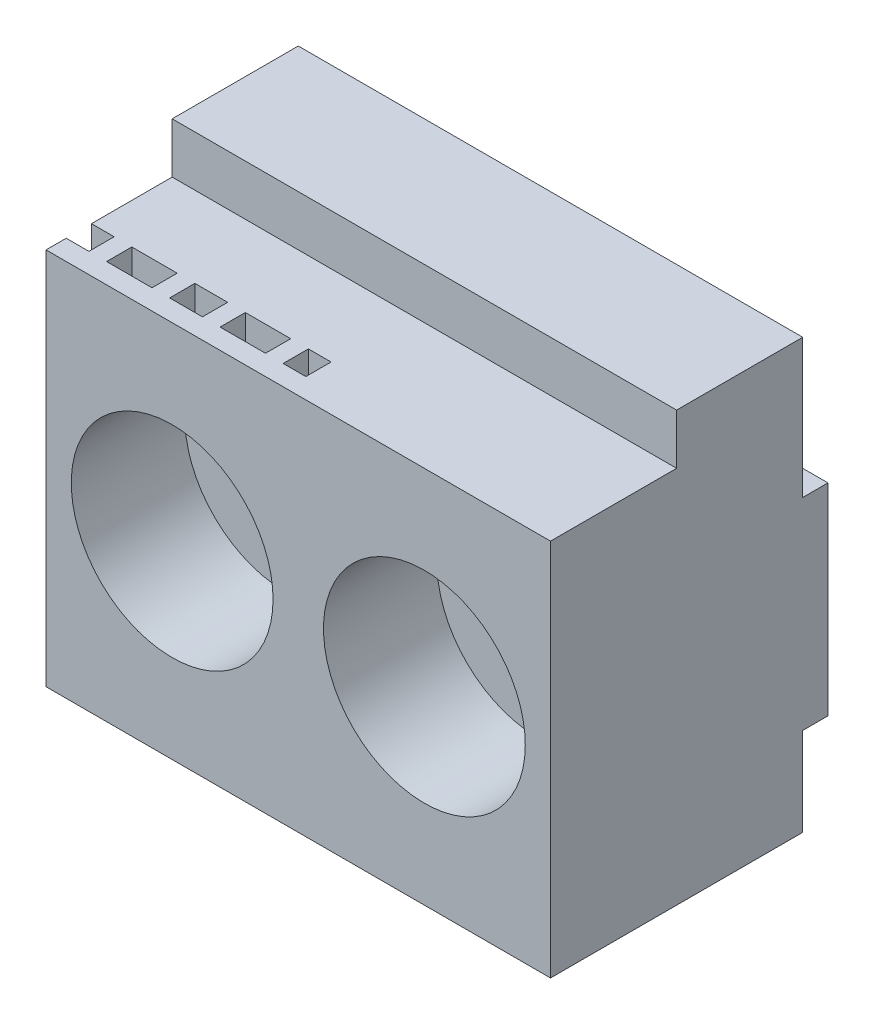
from build123d import *

# Parameters (mm, degrees)
SKETCH_1_W          = 20
SKETCH_1_H          = 17
SKETCH_1_R          = 2.25
EXTRUDE_1_DEPTH     = 11
SKETCH_2_R          = 4
CUT_EXTRUDE_1_DEPTH = 4.5
SKETCH_3_OUTSIDE_W  = 18.692
SKETCH_3_OUTSIDE_H  = 24.692
CUT_EXTRUDE_2_DEPTH = 29.460498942
SKETCH_4_W          = 0.9
SKETCH_4_H          = 1
SKETCH_4_W_2        = 1.8
SKETCH_4_W_3        = 1.3
CUT_EXTRUDE_3_DEPTH = 3


with BuildPart() as part:
    # Sketch 1 → Extrude 1 (new body)
    with BuildSketch(Plane.XY):
        with Locations((10, 8.5)):
            Rectangle(SKETCH_1_W, SKETCH_1_H)
        with Locations((5, 7.5)):
            Circle(SKETCH_1_R, mode=Mode.SUBTRACT)
        with Locations((15, 7.5)):
            Circle(SKETCH_1_R, mode=Mode.SUBTRACT)
    extrude(amount=EXTRUDE_1_DEPTH)

    # Sketch 2 → Cut-Extrude 1 (cut)
    with BuildSketch(Plane.XY.offset(11)):
        with Locations((5, 7.5)):
            Circle(SKETCH_2_R)
        with Locations((15, 7.5)):
            Circle(SKETCH_2_R)
    extrude(amount=-CUT_EXTRUDE_1_DEPTH, mode=Mode.SUBTRACT)

    # Sketch 3 outside → Cut-Extrude 2 (cut, through all)
    with BuildSketch(Plane(origin=(20, 0, 0), x_dir=(0, 0, -1), z_dir=(1, 0, 0))):
        with Locations((-5.5, 8.5)):
            Rectangle(SKETCH_3_OUTSIDE_W, SKETCH_3_OUTSIDE_H)
        Polygon((-6, 15), (-6, 17), (-1, 17), (-1, 11.5), (0, 11.5), (0, 3.5), (-1, 3.5), (-1, 0), (-11, 0), (-11, 15), align=None, mode=Mode.SUBTRACT)
    extrude(amount=-CUT_EXTRUDE_2_DEPTH, mode=Mode.SUBTRACT)

    # Sketch 4 → Cut-Extrude 3 (cut)
    with BuildSketch(Plane(origin=(0, 15, 0), x_dir=(1, 0, 0), z_dir=(0, 1, 0))):
        with Locations((0.45, -9.7)):
            Rectangle(SKETCH_4_W, SKETCH_4_H)
        with Locations((2.5, -9.7)):
            Rectangle(SKETCH_4_W_2, SKETCH_4_H)
        with Locations((4.75, -9.7)):
            Rectangle(SKETCH_4_W_3, SKETCH_4_H)
        with Locations((7, -9.7)):
            Rectangle(SKETCH_4_W_2, SKETCH_4_H)
        with Locations((9.05, -9.7)):
            Rectangle(SKETCH_4_W, SKETCH_4_H)
    extrude(amount=-CUT_EXTRUDE_3_DEPTH, mode=Mode.SUBTRACT)


solid = part.part
